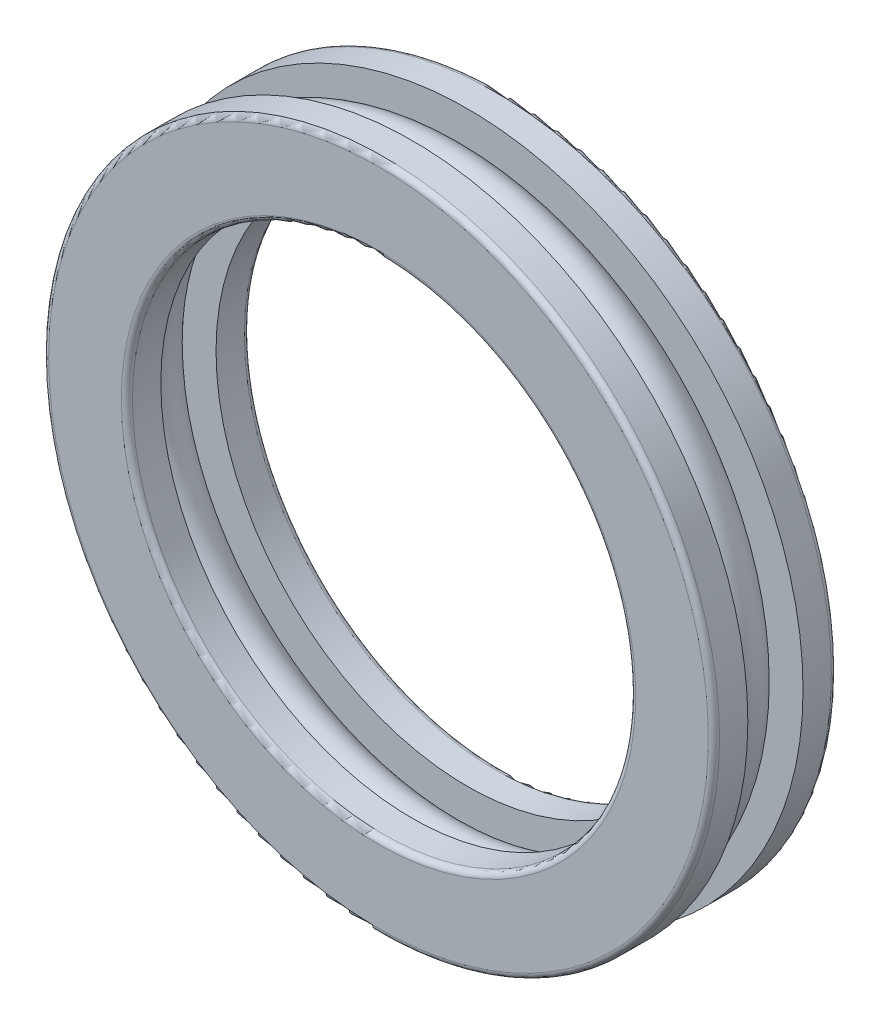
from build123d import *

# Parameters (mm, degrees)
SKETCH_1_R = 4.519033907
SKETCH_1_W = 15
SKETCH_1_H = 6.06230526
FILLET_1_R = 1
FILLET_2_R = 1


with BuildPart() as part:
    # Sketch 1 → Revolve 1 (revolve)
    with BuildSketch(Plane(origin=(0, 0, 0), x_dir=(1, 0, 0), z_dir=(0, 1, 0)), mode=Mode.PRIVATE) as revolve_1_sk:
        with Locations((-52.5, 11)):
            Circle(SKETCH_1_R)
        with Locations((-52.5, 3.03115263)):
            Rectangle(SKETCH_1_W, SKETCH_1_H)
        with Locations((-52.5, 18.96884737)):
            Rectangle(SKETCH_1_W, SKETCH_1_H)
    revolve(revolve_1_sk.sketch.rotate(Axis((0, 0, 0), (0, 0, -1)), 180), axis=Axis((0, 0, 0), (0, 0, -1)))

    # Fillet 1
    fillet_1_edges = [part.edges().sort_by_distance(p)[0] for p in [
        (-60, 0, 0),
        (-45, 0, 0),
    ]]
    fillet(fillet_1_edges, radius=FILLET_1_R)

    # Fillet 2
    fillet_2_edges = [part.edges().sort_by_distance(p)[0] for p in [
        (-60, 0, -22),
        (-45, 0, -22),
    ]]
    fillet(fillet_2_edges, radius=FILLET_2_R)


solid = part.part
